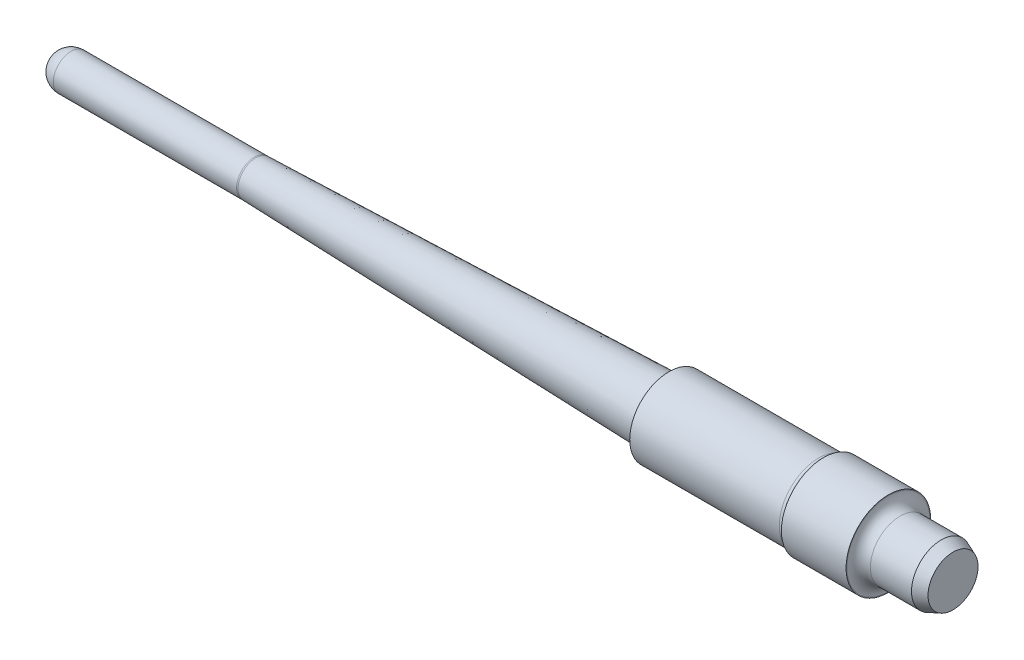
ISO-10303-21;
HEADER;
FILE_DESCRIPTION(('STEP AP214'),'2;1');
FILE_NAME('part.step','',(''),(''),'','','');
FILE_SCHEMA(('AUTOMOTIVE_DESIGN { 1 0 10303 214 1 1 1 1 }'));
ENDSEC;
DATA;
#1=APPLICATION_CONTEXT('core data for automotive mechanical design processes');
#2=APPLICATION_PROTOCOL_DEFINITION('international standard','automotive_design',2000,#1);
#3=PRODUCT_CONTEXT('',#1,'mechanical');
#4=PRODUCT('Part','Part','',(#3));
#5=PRODUCT_RELATED_PRODUCT_CATEGORY('part','',(#4));
#6=PRODUCT_DEFINITION_FORMATION('','',#4);
#7=PRODUCT_DEFINITION_CONTEXT('part definition',#1,'design');
#8=PRODUCT_DEFINITION('design','',#6,#7);
#9=PRODUCT_DEFINITION_SHAPE('','',#8);
#10=(LENGTH_UNIT() NAMED_UNIT(*) SI_UNIT(.MILLI.,.METRE.));
#11=(NAMED_UNIT(*) PLANE_ANGLE_UNIT() SI_UNIT($,.RADIAN.));
#12=(NAMED_UNIT(*) SI_UNIT($,.STERADIAN.) SOLID_ANGLE_UNIT());
#13=UNCERTAINTY_MEASURE_WITH_UNIT(LENGTH_MEASURE(1.E-05),#10,'distance_accuracy_value','');
#14=(GEOMETRIC_REPRESENTATION_CONTEXT(3) GLOBAL_UNCERTAINTY_ASSIGNED_CONTEXT((#13)) GLOBAL_UNIT_ASSIGNED_CONTEXT((#10,
#11,#12)) REPRESENTATION_CONTEXT('',''));
#15=CARTESIAN_POINT('',(0.,0.,0.));
#16=DIRECTION('',(0.,0.,1.));
#17=DIRECTION('',(1.,0.,0.));
#18=AXIS2_PLACEMENT_3D('',#15,#16,#17);
#19=CARTESIAN_POINT('',(1.156,0.,0.));
#20=DIRECTION('',(-1.,0.,0.));
#21=DIRECTION('',(0.,1.,0.));
#22=AXIS2_PLACEMENT_3D('',#19,#20,#21);
#23=SPHERICAL_SURFACE('',#22,1.156);
#24=CARTESIAN_POINT('',(1.156,0.,0.));
#25=DIRECTION('',(-1.,0.,0.));
#26=DIRECTION('',(0.,0.,1.));
#27=AXIS2_PLACEMENT_3D('',#24,#25,#26);
#28=CIRCLE('',#27,1.156);
#29=CARTESIAN_POINT('',(1.156,0.,1.156));
#30=VERTEX_POINT('',#29);
#31=EDGE_CURVE('E58',#30,#30,#28,.T.);
#32=ORIENTED_EDGE('',*,*,#31,.T.);
#33=EDGE_LOOP('',(#32));
#34=FACE_BOUND('',#33,.T.);
#35=ADVANCED_FACE('F29',(#34),#23,.T.);
#36=CARTESIAN_POINT('',(0.,0.,0.));
#37=DIRECTION('',(-1.,0.,0.));
#38=DIRECTION('',(0.,0.,1.));
#39=AXIS2_PLACEMENT_3D('',#36,#37,#38);
#40=CYLINDRICAL_SURFACE('',#39,1.156);
#41=ORIENTED_EDGE('',*,*,#31,.F.);
#42=EDGE_LOOP('',(#41));
#43=FACE_BOUND('',#42,.T.);
#44=CARTESIAN_POINT('',(13.0344309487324,0.,0.));
#45=DIRECTION('',(-1.,0.,0.));
#46=DIRECTION('',(0.,0.,1.));
#47=AXIS2_PLACEMENT_3D('',#44,#45,#46);
#48=CIRCLE('',#47,1.156);
#49=CARTESIAN_POINT('',(13.0344309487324,0.,1.156));
#50=VERTEX_POINT('',#49);
#51=EDGE_CURVE('E61',#50,#50,#48,.T.);
#52=ORIENTED_EDGE('',*,*,#51,.T.);
#53=EDGE_LOOP('',(#52));
#54=FACE_BOUND('',#53,.T.);
#55=ADVANCED_FACE('F95',(#43,#54),#40,.T.);
#56=CARTESIAN_POINT('',(13.0344309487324,0.,0.));
#57=DIRECTION('',(-1.,0.,0.));
#58=DIRECTION('',(0.,0.,1.));
#59=AXIS2_PLACEMENT_3D('',#56,#57,#58);
#60=TOROIDAL_SURFACE('',#59,4.331,3.175);
#61=ORIENTED_EDGE('',*,*,#51,.F.);
#62=EDGE_LOOP('',(#61));
#63=FACE_BOUND('',#62,.T.);
#64=CARTESIAN_POINT('',(13.1275490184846,0.,0.));
#65=DIRECTION('',(-1.,0.,0.));
#66=DIRECTION('',(0.,0.,1.));
#67=AXIS2_PLACEMENT_3D('',#64,#65,#66);
#68=CIRCLE('',#67,1.15736580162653);
#69=CARTESIAN_POINT('',(13.1275490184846,0.,1.15736580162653));
#70=VERTEX_POINT('',#69);
#71=EDGE_CURVE('E64',#70,#70,#68,.T.);
#72=ORIENTED_EDGE('',*,*,#71,.T.);
#73=EDGE_LOOP('',(#72));
#74=FACE_BOUND('',#73,.T.);
#75=ADVANCED_FACE('F101',(#63,#74),#60,.F.);
#76=CARTESIAN_POINT('',(39.9034,0.,0.));
#77=DIRECTION('',(1.,0.,0.));
#78=DIRECTION('',(0.,0.,-1.));
#79=AXIS2_PLACEMENT_3D('',#76,#77,#78);
#80=CONICAL_SURFACE('',#79,1.943,0.0293327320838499);
#81=CARTESIAN_POINT('',(39.5335741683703,0.,0.));
#82=DIRECTION('',(1.,0.,0.));
#83=DIRECTION('',(0.,0.,-1.));
#84=AXIS2_PLACEMENT_3D('',#81,#82,#83);
#85=CIRCLE('',#84,1.93214888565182);
#86=CARTESIAN_POINT('',(39.5335741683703,0.,-1.93214888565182));
#87=VERTEX_POINT('',#86);
#88=EDGE_CURVE('E40',#87,#87,#85,.F.);
#89=ORIENTED_EDGE('',*,*,#88,.T.);
#90=EDGE_LOOP('',(#89));
#91=FACE_BOUND('',#90,.T.);
#92=ORIENTED_EDGE('',*,*,#71,.F.);
#93=EDGE_LOOP('',(#92));
#94=FACE_BOUND('',#93,.T.);
#95=ADVANCED_FACE('F123',(#91,#94),#80,.T.);
#96=CARTESIAN_POINT('',(39.9034,2.54,0.));
#97=DIRECTION('',(1.,0.,0.));
#98=DIRECTION('',(0.,0.,-1.));
#99=AXIS2_PLACEMENT_3D('',#96,#97,#98);
#100=PLANE('',#99);
#101=CARTESIAN_POINT('',(39.9034,0.,0.));
#102=DIRECTION('',(1.,0.,0.));
#103=DIRECTION('',(0.,0.,-1.));
#104=AXIS2_PLACEMENT_3D('',#101,#102,#103);
#105=CIRCLE('',#104,2.31298498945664);
#106=CARTESIAN_POINT('',(39.9034,0.,-2.31298498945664));
#107=VERTEX_POINT('',#106);
#108=EDGE_CURVE('E36',#107,#107,#105,.T.);
#109=ORIENTED_EDGE('',*,*,#108,.T.);
#110=EDGE_LOOP('',(#109));
#111=FACE_BOUND('',#110,.T.);
#112=CARTESIAN_POINT('',(39.9034,0.,0.));
#113=DIRECTION('',(-1.,0.,0.));
#114=DIRECTION('',(0.,0.,1.));
#115=AXIS2_PLACEMENT_3D('',#112,#113,#114);
#116=CIRCLE('',#115,2.54);
#117=CARTESIAN_POINT('',(39.9034,0.,2.54));
#118=VERTEX_POINT('',#117);
#119=EDGE_CURVE('E67',#118,#118,#116,.T.);
#120=ORIENTED_EDGE('',*,*,#119,.T.);
#121=EDGE_LOOP('',(#120));
#122=FACE_BOUND('',#121,.T.);
#123=ADVANCED_FACE('F126',(#111,#122),#100,.F.);
#124=CARTESIAN_POINT('',(0.,0.,0.));
#125=DIRECTION('',(-1.,0.,0.));
#126=DIRECTION('',(0.,0.,1.));
#127=AXIS2_PLACEMENT_3D('',#124,#125,#126);
#128=CYLINDRICAL_SURFACE('',#127,2.54);
#129=CARTESIAN_POINT('',(49.5995365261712,0.,0.));
#130=DIRECTION('',(1.,0.,0.));
#131=DIRECTION('',(0.,0.,-1.));
#132=AXIS2_PLACEMENT_3D('',#129,#130,#131);
#133=CIRCLE('',#132,2.54);
#134=CARTESIAN_POINT('',(49.5995365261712,0.,-2.54));
#135=VERTEX_POINT('',#134);
#136=EDGE_CURVE('E10',#135,#135,#133,.F.);
#137=ORIENTED_EDGE('',*,*,#136,.T.);
#138=EDGE_LOOP('',(#137));
#139=FACE_BOUND('',#138,.T.);
#140=ORIENTED_EDGE('',*,*,#119,.F.);
#141=EDGE_LOOP('',(#140));
#142=FACE_BOUND('',#141,.T.);
#143=ADVANCED_FACE('F91',(#139,#142),#128,.T.);
#144=CARTESIAN_POINT('',(0.,0.,0.));
#145=DIRECTION('',(-1.,0.,0.));
#146=DIRECTION('',(0.,0.,1.));
#147=AXIS2_PLACEMENT_3D('',#144,#145,#146);
#148=CYLINDRICAL_SURFACE('',#147,2.743);
#149=CARTESIAN_POINT('',(49.9364,0.,0.));
#150=DIRECTION('',(-1.,0.,0.));
#151=DIRECTION('',(0.,0.,1.));
#152=AXIS2_PLACEMENT_3D('',#149,#150,#151);
#153=CIRCLE('',#152,2.743);
#154=CARTESIAN_POINT('',(49.9364,0.,2.743));
#155=VERTEX_POINT('',#154);
#156=EDGE_CURVE('E70',#155,#155,#153,.T.);
#157=ORIENTED_EDGE('',*,*,#156,.F.);
#158=EDGE_LOOP('',(#157));
#159=FACE_BOUND('',#158,.T.);
#160=CARTESIAN_POINT('',(54.1274,0.,0.));
#161=DIRECTION('',(-1.,0.,0.));
#162=DIRECTION('',(0.,0.,1.));
#163=AXIS2_PLACEMENT_3D('',#160,#161,#162);
#164=CIRCLE('',#163,2.743);
#165=CARTESIAN_POINT('',(54.1274,0.,2.743));
#166=VERTEX_POINT('',#165);
#167=EDGE_CURVE('E73',#166,#166,#164,.T.);
#168=ORIENTED_EDGE('',*,*,#167,.T.);
#169=EDGE_LOOP('',(#168));
#170=FACE_BOUND('',#169,.T.);
#171=ADVANCED_FACE('F77',(#159,#170),#148,.T.);
#172=CARTESIAN_POINT('',(54.1274,1.93,0.));
#173=DIRECTION('',(-1.,0.,0.));
#174=DIRECTION('',(0.,0.,1.));
#175=AXIS2_PLACEMENT_3D('',#172,#173,#174);
#176=PLANE('',#175);
#177=CARTESIAN_POINT('',(54.1274,0.,0.));
#178=DIRECTION('',(-1.,0.,0.));
#179=DIRECTION('',(0.,0.,1.));
#180=AXIS2_PLACEMENT_3D('',#177,#178,#179);
#181=CIRCLE('',#180,2.692);
#182=CARTESIAN_POINT('',(54.1274,0.,2.692));
#183=VERTEX_POINT('',#182);
#184=EDGE_CURVE('E49',#183,#183,#181,.T.);
#185=ORIENTED_EDGE('',*,*,#184,.T.);
#186=EDGE_LOOP('',(#185));
#187=FACE_BOUND('',#186,.T.);
#188=ORIENTED_EDGE('',*,*,#167,.F.);
#189=EDGE_LOOP('',(#188));
#190=FACE_BOUND('',#189,.T.);
#191=ADVANCED_FACE('F79',(#187,#190),#176,.F.);
#192=CARTESIAN_POINT('',(0.,0.,0.));
#193=DIRECTION('',(-1.,0.,0.));
#194=DIRECTION('',(0.,0.,1.));
#195=AXIS2_PLACEMENT_3D('',#192,#193,#194);
#196=CYLINDRICAL_SURFACE('',#195,1.93);
#197=CARTESIAN_POINT('',(54.8894,0.,0.));
#198=DIRECTION('',(-1.,0.,0.));
#199=DIRECTION('',(0.,0.,1.));
#200=AXIS2_PLACEMENT_3D('',#197,#198,#199);
#201=CIRCLE('',#200,1.93);
#202=CARTESIAN_POINT('',(54.8894,0.,1.93));
#203=VERTEX_POINT('',#202);
#204=EDGE_CURVE('E44',#203,#203,#201,.F.);
#205=ORIENTED_EDGE('',*,*,#204,.T.);
#206=EDGE_LOOP('',(#205));
#207=FACE_BOUND('',#206,.T.);
#208=CARTESIAN_POINT('',(57.5564,0.,0.));
#209=DIRECTION('',(-1.,0.,0.));
#210=DIRECTION('',(0.,0.,1.));
#211=AXIS2_PLACEMENT_3D('',#208,#209,#210);
#212=CIRCLE('',#211,1.93);
#213=CARTESIAN_POINT('',(57.5564,0.,1.93));
#214=VERTEX_POINT('',#213);
#215=EDGE_CURVE('E55',#214,#214,#212,.T.);
#216=ORIENTED_EDGE('',*,*,#215,.T.);
#217=EDGE_LOOP('',(#216));
#218=FACE_BOUND('',#217,.T.);
#219=ADVANCED_FACE('F81',(#207,#218),#196,.T.);
#220=CARTESIAN_POINT('',(58.3184,0.,0.));
#221=DIRECTION('',(-1.,0.,0.));
#222=DIRECTION('',(0.,0.,1.));
#223=AXIS2_PLACEMENT_3D('',#220,#221,#222);
#224=PLANE('',#223);
#225=CARTESIAN_POINT('',(58.3184,0.,0.));
#226=DIRECTION('',(-1.,0.,0.));
#227=DIRECTION('',(0.,0.,1.));
#228=AXIS2_PLACEMENT_3D('',#225,#226,#227);
#229=CIRCLE('',#228,1.62213201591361);
#230=CARTESIAN_POINT('',(58.3184,0.,1.62213201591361));
#231=VERTEX_POINT('',#230);
#232=EDGE_CURVE('E52',#231,#231,#229,.F.);
#233=ORIENTED_EDGE('',*,*,#232,.T.);
#234=EDGE_LOOP('',(#233));
#235=FACE_BOUND('',#234,.T.);
#236=ADVANCED_FACE('F88',(#235),#224,.F.);
#237=CARTESIAN_POINT('',(57.5564,0.,0.));
#238=DIRECTION('',(-1.,0.,0.));
#239=DIRECTION('',(0.,0.,1.));
#240=AXIS2_PLACEMENT_3D('',#237,#238,#239);
#241=CONICAL_SURFACE('',#240,1.93,0.383972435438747);
#242=ORIENTED_EDGE('',*,*,#232,.F.);
#243=EDGE_LOOP('',(#242));
#244=FACE_BOUND('',#243,.T.);
#245=ORIENTED_EDGE('',*,*,#215,.F.);
#246=EDGE_LOOP('',(#245));
#247=FACE_BOUND('',#246,.T.);
#248=ADVANCED_FACE('F106',(#244,#247),#241,.T.);
#249=CARTESIAN_POINT('',(54.8894,0.,0.));
#250=DIRECTION('',(-1.,0.,0.));
#251=DIRECTION('',(0.,0.,1.));
#252=AXIS2_PLACEMENT_3D('',#249,#250,#251);
#253=TOROIDAL_SURFACE('',#252,2.692,0.762);
#254=ORIENTED_EDGE('',*,*,#204,.F.);
#255=EDGE_LOOP('',(#254));
#256=FACE_BOUND('',#255,.T.);
#257=ORIENTED_EDGE('',*,*,#184,.F.);
#258=EDGE_LOOP('',(#257));
#259=FACE_BOUND('',#258,.T.);
#260=ADVANCED_FACE('F109',(#256,#259),#253,.F.);
#261=CARTESIAN_POINT('',(39.5224,0.,0.));
#262=DIRECTION('',(1.,0.,0.));
#263=DIRECTION('',(0.,0.,-1.));
#264=AXIS2_PLACEMENT_3D('',#261,#262,#263);
#265=TOROIDAL_SURFACE('',#264,2.31298498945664,0.381);
#266=ORIENTED_EDGE('',*,*,#108,.F.);
#267=EDGE_LOOP('',(#266));
#268=FACE_BOUND('',#267,.T.);
#269=ORIENTED_EDGE('',*,*,#88,.F.);
#270=EDGE_LOOP('',(#269));
#271=FACE_BOUND('',#270,.T.);
#272=ADVANCED_FACE('F112',(#268,#271),#265,.F.);
#273=CARTESIAN_POINT('',(49.5995365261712,0.,0.));
#274=DIRECTION('',(1.,0.,0.));
#275=DIRECTION('',(0.,0.,-1.));
#276=AXIS2_PLACEMENT_3D('',#273,#274,#275);
#277=TOROIDAL_SURFACE('',#276,2.921,0.381);
#278=ORIENTED_EDGE('',*,*,#156,.T.);
#279=EDGE_LOOP('',(#278));
#280=FACE_BOUND('',#279,.T.);
#281=ORIENTED_EDGE('',*,*,#136,.F.);
#282=EDGE_LOOP('',(#281));
#283=FACE_BOUND('',#282,.T.);
#284=ADVANCED_FACE('F31',(#280,#283),#277,.F.);
#285=CLOSED_SHELL('',(#35,#55,#75,#95,#123,#143,#171,#191,#219,#236,#248,#260,#272,#284));
#286=MANIFOLD_SOLID_BREP('B2',#285);
#287=ADVANCED_BREP_SHAPE_REPRESENTATION('',(#18,#286),#14);
#288=SHAPE_DEFINITION_REPRESENTATION(#9,#287);
ENDSEC;
END-ISO-10303-21;
